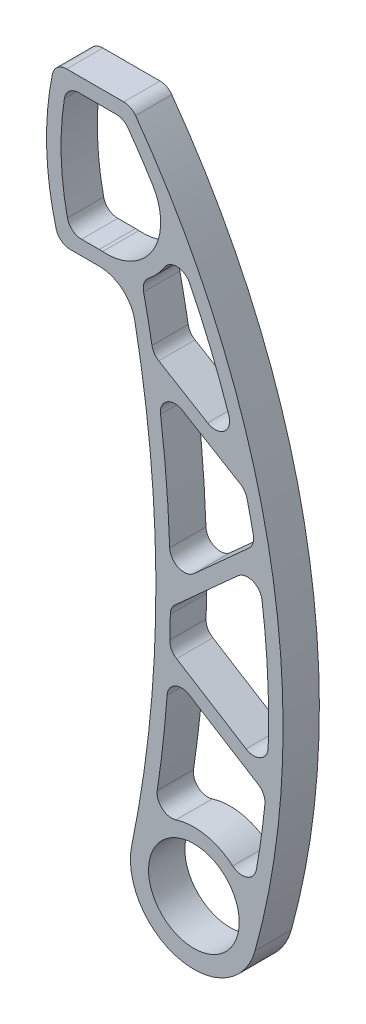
from build123d import *

# Parameters (mm, degrees)
SKETCH1_R           = 15.875
MAIN_BODY_DEPTH     = 6.35
CUT_EXTRUDE2_DEPTH  = 235.696604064
CUT_EXTRUDE3_DEPTH  = 235.696604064
EXTRUDE_THIN2_DEPTH = 12.7
EXTRUDE_THIN3_DEPTH = 12.7
EXTRUDE_THIN4_DEPTH = 12.7
FILLET1_R           = 5.08


with BuildPart() as part:
    # Sketch1 → Main Body (new, symmetric)
    with BuildSketch(Plane.XY):
        with BuildLine():
            ThreePointArc((-21.762193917, 4.511933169), (-5.212160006, -21.605184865), (21.425651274, -5.906952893))
            ThreePointArc((21.425651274, -5.906952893), (26.924786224, 115.050760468), (-20.419792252, 226.493569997))
            ThreePointArc((-20.419792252, 226.493569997), (-22.225485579, 228.042838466), (-24.538564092, 228.6))
            Line((-24.538564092, 228.6), (-44.576546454, 228.6))
            ThreePointArc((-44.576546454, 228.6), (-47.789420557, 227.45495108), (-49.553909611, 224.536))
            ThreePointArc((-49.553909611, 224.536), (-51.565277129, 201.316941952), (-48.232657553, 178.250431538))
            ThreePointArc((-48.232657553, 178.250431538), (-46.420642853, 175.523684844), (-43.321356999, 174.468709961))
            Line((-43.321356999, 174.468709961), (-33.161356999, 174.468709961))
            ThreePointArc((-33.161356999, 174.468709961), (-25.078491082, 171.56448857), (-20.692386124, 164.180092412))
            ThreePointArc((-20.692386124, 164.180092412), (-13.308575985, 84.292955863), (-21.762193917, 4.511933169))
        make_face()
        Circle(SKETCH1_R, mode=Mode.SUBTRACT)
    extrude(amount=MAIN_BODY_DEPTH, both=True)

    # Sketch4 → Cut-Extrude2 (cut, through all)
    with BuildSketch(Plane.XY.offset(6.35)):
        with BuildLine():
            Line((-27.152309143, 223.52), (-40.333560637, 223.52))
            ThreePointArc((-40.333560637, 223.52), (-43.634474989, 222.301394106), (-45.351722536, 219.230222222))
            ThreePointArc((-45.351722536, 219.230222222), (-46.483659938, 201.33567514), (-44.28620535, 183.540527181))
            ThreePointArc((-44.28620535, 183.540527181), (-42.508336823, 180.670530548), (-39.324123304, 179.548709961))
            Line((-39.324123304, 179.548709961), (-33.161356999, 179.548709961))
            ThreePointArc((-33.161356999, 179.548709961), (-32.560112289, 179.538541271), (-31.959555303, 179.508046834))
            ThreePointArc((-31.959555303, 179.508046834), (-14.333571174, 188.718502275), (-14.513859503, 208.605063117))
            ThreePointArc((-14.513859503, 208.605063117), (-18.66781694, 215.049705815), (-23.00445466, 221.372866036))
            ThreePointArc((-23.00445466, 221.372866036), (-24.816988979, 222.951394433), (-27.152309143, 223.52))
        make_face()
    extrude(amount=-CUT_EXTRUDE2_DEPTH, mode=Mode.SUBTRACT)

    # Sketch5 → Cut-Extrude3 (cut, through all)
    with BuildSketch(Plane.XY.offset(6.35)):
        with BuildLine():
            ThreePointArc((13.585810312, 15.954240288), (4.172073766, 20.53547724), (-6.283048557, 19.990881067))
            ThreePointArc((-6.283048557, 19.990881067), (-11.110015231, 20.978232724), (-12.829300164, 25.595432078))
            ThreePointArc((-12.829300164, 25.595432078), (-8.431983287, 100.23923629), (-17.615268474, 174.446386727))
            ThreePointArc((-17.615268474, 174.446386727), (-17.430342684, 177.248224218), (-15.785291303, 179.523811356))
            ThreePointArc((-15.785291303, 179.523811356), (-12.77711823, 182.327036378), (-10.288561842, 185.600301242))
            ThreePointArc((-10.288561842, 185.600301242), (-5.726128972, 187.95428257), (-1.440684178, 185.127272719))
            ThreePointArc((-1.440684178, 185.127272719), (23.567288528, 103.894782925), (21.878047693, 18.916770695))
            ThreePointArc((21.878047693, 18.916770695), (18.588449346, 15.038071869), (13.585810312, 15.954240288))
        make_face()
    extrude(amount=-CUT_EXTRUDE3_DEPTH, mode=Mode.SUBTRACT)

    # Sketch6 → Extrude-Thin2 (add)
    with BuildSketch(Plane.XY.offset(6.35)):
        Polygon((21.578896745, 135.865908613), (-15.281464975, 157.996127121), (-17.896319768, 153.640793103), (18.964041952, 131.510574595), align=None)
    extrude(amount=-EXTRUDE_THIN2_DEPTH)

    # Sketch6_3 → Extrude-Thin3 (add)
    with BuildSketch(Plane.XY.offset(6.35)):
        Polygon((-9.065756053, 82.788940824), (25.844373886, 114.249020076), (22.443587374, 118.022751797), (-12.466542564, 86.562672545), align=None)
    extrude(amount=-EXTRUDE_THIN3_DEPTH)

    # Sketch6_4 → Extrude-Thin4 (add)
    with BuildSketch(Plane.XY.offset(6.35)):
        Polygon((29.168469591, 46.985115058), (-9.804881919, 71.309121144), (-12.494545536, 66.999584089), (26.478805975, 42.675578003), align=None)
        Polygon((-9.065756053, 82.788940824), (25.844373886, 114.249020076), (22.443587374, 118.022751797), (-12.466542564, 86.562672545), align=None)
        Polygon((21.578896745, 135.865908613), (-15.281464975, 157.996127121), (-17.896319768, 153.640793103), (18.964041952, 131.510574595), align=None)
        with BuildLine():
            ThreePointArc((26.876755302, 18.011606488), (28.59801966, 104.600576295), (3.115962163, 187.373018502))
            Line((3.115962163, 187.373018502), (-1.440684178, 185.127272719))
            ThreePointArc((-1.440684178, 185.127272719), (23.567288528, 103.894782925), (21.878047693, 18.916770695))
            Line((21.878047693, 18.916770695), (26.876755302, 18.011606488))
        make_face()
        with BuildLine():
            ThreePointArc((-12.829300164, 25.595432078), (-8.431983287, 100.23923629), (-17.615268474, 174.446386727))
            Line((-17.615268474, 174.446386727), (-22.579270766, 173.366997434))
            ThreePointArc((-22.579270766, 173.366997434), (-13.50935947, 100.075984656), (-17.852388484, 26.353708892))
            Line((-17.852388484, 26.353708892), (-12.829300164, 25.595432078))
        make_face()
    extrude(amount=-EXTRUDE_THIN4_DEPTH)

    # Fillet1
    fillet1_edges = [part.edges().sort_by_distance(p)[0] for p in [
        (-13.196116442, 150.818885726, 0),
        (-14.283234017, 157.396809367, 0),
        (-8.233187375, 90.377659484, 0),
        (21.383321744, 117.067268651, 0),
        (-8.234148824, 83.538363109, 0),
        (22.442285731, 111.183148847, 0),
        (-8.824537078, 64.709062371, 0),
        (25.162879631, 43.496872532, 0),
        (-8.550001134, 70.525926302, 0),
        (25.597431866, 49.21386727, 0),
        (16.189990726, 139.101299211, 0),
        (18.066788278, 132.049267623, 0),
    ]]
    fillet(fillet1_edges, radius=FILLET1_R)


solid = part.part
